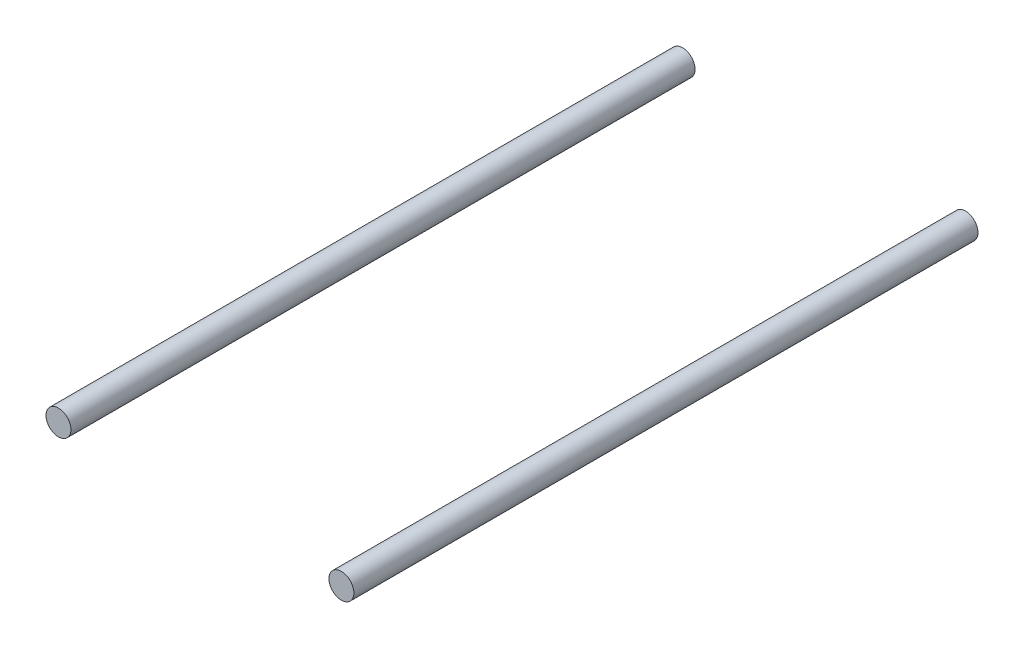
from build123d import *

# Parameters (mm, degrees)
EXTRUSION1_DEPTH        = 10
EXTRUSION1_DEPTH_BACK   = 65
ESQUISSE1_R             = 1.5
EXTRUSION1_2_DEPTH      = 10
EXTRUSION1_2_DEPTH_BACK = 65


with BuildPart() as part:
    # Esquisse1 → Extrusion1 (new, two sides: drawn at the far end of the back side and taken through both)
    with BuildSketch(Plane.XY.offset(-EXTRUSION1_DEPTH_BACK)):
        with Locations((8, 7.5)):
            Circle(ESQUISSE1_R)
    extrude(amount=EXTRUSION1_DEPTH + EXTRUSION1_DEPTH_BACK)


with BuildPart() as body_2:
    # Esquisse1 → Extrusion1 2 (new, two sides: drawn at the far end of the back side and taken through both)
    with BuildSketch(Plane.XY.offset(-EXTRUSION1_2_DEPTH_BACK)):
        with Locations((42, 7.5)):
            Circle(ESQUISSE1_R)
    extrude(amount=EXTRUSION1_2_DEPTH + EXTRUSION1_2_DEPTH_BACK)


solid = Compound([part.part, body_2.part])
